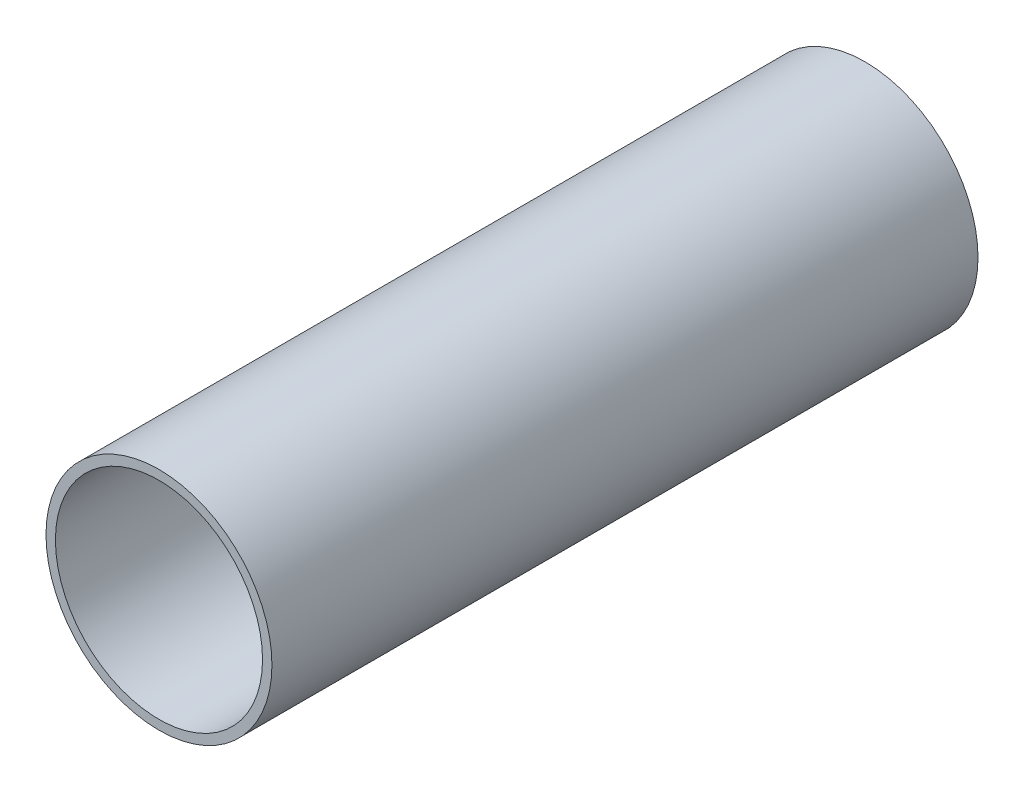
from build123d import *

# Parameters (mm, degrees)
ESQUISSE1_R      = 24
ESQUISSE1_R_2    = 22
EXTRUSION1_DEPTH = 150


with BuildPart() as part:
    # Esquisse1 → Extrusion1 (new body)
    with BuildSketch(Plane.XY):
        Circle(ESQUISSE1_R)
        Circle(ESQUISSE1_R_2, mode=Mode.SUBTRACT)
    extrude(amount=EXTRUSION1_DEPTH)


solid = part.part
